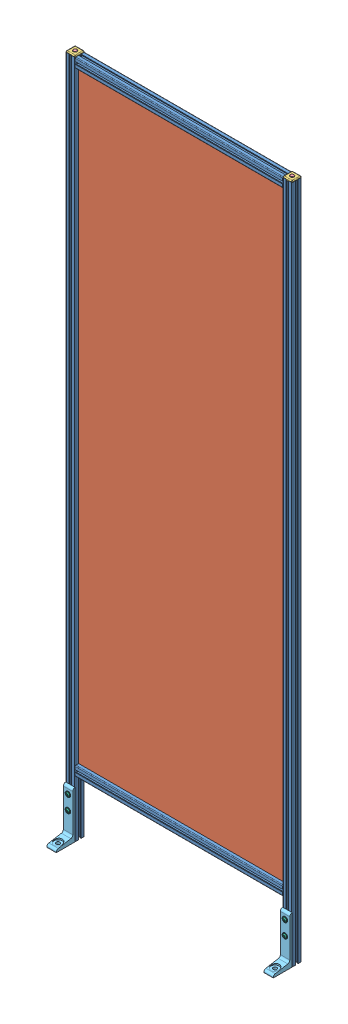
SolidWorks assembly 10-10 Guarding.sldasm, configuration Default (file format 4700). Lengths in mm.
Overall size (609.6 1833.07 76.2).
27 component instances, 7 part files, 27 mates.
Components (placement in the parent):
- 650000-1: 650000.sldprt [72] at (-12.7 -1828.8 -12.7) x (-1 0 0) z (0 -1 0) size (25.4 25.4 1828.8)
- 650000-2: 650000.sldprt [22] at (-25.4 -12.7 -12.7) x (0 1 0) z (1 0 0) size (25.4 25.4 558.8)
- 650000-3: 650000.sldprt [72] at (-596.9 0 -12.7) x (1 0 0) z (0 1 0) size (25.4 25.4 1828.8)
- 650000-4: 650000.sldprt [22] at (-25.4 -1663.7 -12.7) x (0 -1 0) z (1 0 0) size (25.4 25.4 558.8)
- 655433-2: 655433.sldprt [22.5x64.5] at (-590.55 -1657.35 -14.9479) x (0 0 1) z (-1 0 0) size (4.5 1638.3 571.5)
- 655000-1: 655000.sldasm [Default] at (-596.9 0 -12.7) x (0 0 -1) z (0 1 0) size (25.4 25.4 14.43)
  - TSLOT ENDCAPS-1: TSLOT ENDCAPS.SLDPRT [1010_655000] at origin size (25.4 25.4 5.46)
  - 651084-1: 651084.SLDPRT [Default] at (-0.0554 -0.0554 4.2672) x (-0.923728 -0.383049 0) z (0 0 -1) size (9.98 9.98 14.43)
- 655000-2: 655000.sldasm [Default] at (-12.7 0 -12.7) x (0 0 1) z (0 1 0) size (25.4 25.4 14.43)
  - TSLOT ENDCAPS-1: TSLOT ENDCAPS.SLDPRT [1010_655000] at origin size (25.4 25.4 5.46)
  - 651084-1: 651084.SLDPRT [Default] at (-0.0554 -0.0554 4.2672) x (-0.923728 -0.383049 0) z (0 0 -1) size (9.98 9.98 14.43)
- 655275-1: 655275.sldasm [655275 (With Recomended Fasteners)] at (-596.9 -1828.8 0) x (0 1 0) z (1 0 0) size (127 57.15 25.4)
  - Econ BP-1: Econ BP.SLDPRT [655275] at origin size (127 50.8 25.4)
  - 651130-1: 651130.SLDASM [Default] at (107.95 -6.35 0) x (0 0 1) z (-1 0 0) size (13.72 16 25.4)
    - FBHSCS-1: FBHSCS.SLDPRT [651136] at origin size (13.72 16 13.72)
    - 651163-1: 651163.SLDPRT [Default] at (-5.588 1.27 12.7) x (0 0 -1) z (0 -1 0) size (25.4 11.18 3.66)
  - 651130-2: 651130.SLDASM [Default] at (69.85 -6.35 0) x (0 0 1) z (-1 0 0) size (13.72 16 25.4)
    - FBHSCS-1: FBHSCS.SLDPRT [651136] at origin size (13.72 16 13.72)
    - 651163-1: 651163.SLDPRT [Default] at (-5.588 1.27 12.7) x (0 0 -1) z (0 -1 0) size (25.4 11.18 3.66)
- 655275-2: 655275.sldasm [655275 (With Recomended Fasteners)] at (-12.7 -1828.8 0) x (0 1 0) z (1 0 0) size (127 57.15 25.4)
  - Econ BP-1: Econ BP.SLDPRT [655275] at origin size (127 50.8 25.4)
  - 651130-1: 651130.SLDASM [Default] at (107.95 -6.35 0) x (0 0 1) z (-1 0 0) size (13.72 16 25.4)
    - FBHSCS-1: FBHSCS.SLDPRT [651136] at origin size (13.72 16 13.72)
    - 651163-1: 651163.SLDPRT [Default] at (-5.588 1.27 12.7) x (0 0 -1) z (0 -1 0) size (25.4 11.18 3.66)
  - 651130-2: 651130.SLDASM [Default] at (69.85 -6.35 0) x (0 0 1) z (-1 0 0) size (13.72 16 25.4)
    - FBHSCS-1: FBHSCS.SLDPRT [651136] at origin size (13.72 16 13.72)
    - 651163-1: 651163.SLDPRT [Default] at (-5.588 1.27 12.7) x (0 0 -1) z (0 -1 0) size (25.4 11.18 3.66)
Mates (geometry in assembly coordinates):
- Coincident1: coincident anti-aligned: plane of 650000-1; plane of 650000-2 through (-542.4905 -12.7 -12.7) normal (1 0 0)
- Coincident3: coincident aligned: plane of 650000-1; plane of 650000-2
- Coincident5: coincident anti-aligned: plane of 650000-1 through (-529.7905 -1828.8 -12.7) normal (0 0 -1); plane of 650000-2
- Coincident7: coincident anti-aligned: plane of 650000-2 through (-1101.2905 -12.7 -12.7) normal (-1 0 0); plane of 650000-3
- Coincident10: coincident anti-aligned: plane of 650000-2; plane of 650000-3
- Coincident11: coincident aligned: plane of 650000-2 through (-1101.2905 0 -15.9258) normal (0 1 0); plane of 650000-3 through (-1124.6585 0 -2.032) normal (0 1 0)
- Coincident12: coincident anti-aligned: plane of 650000-1; plane of 650000-4 through (-542.4905 -1663.7 -12.7) normal (1 0 0)
- Coincident13: coincident aligned: plane of 650000-1 through (-529.7905 -1828.8 -12.7) normal (0 0 -1); plane of 650000-4
- Distance1: distance = 152.4 mm aligned: plane of 650000-4 through (-584.2 -1676.4 -15.9258) normal (0 -1 0); plane of 650000-1 through (-2.032 -1828.8 -2.032) normal (0 -1 0)
- Width1: width aligned: plane of 655433-2 through (-536.1405 -1657.35 -10.4521) normal (1 0 0); plane of 655433-2 through (-1107.6405 -1657.35 -10.4521) normal (-1 0 0); plane of 650000-1 through (-517.0905 0 -15.9258) normal (1 0 0); plane of 650000-3 through (-1126.6905 -1828.8 -15.9258) normal (-1 0 0)
- Width2: width aligned: plane of 655433-2 through (-1107.6405 -19.05 -10.4521) normal (0 1 0); plane of 655433-2 through (-1107.6405 -1657.35 -10.4521) normal (0 -1 0); plane of 650000-2 through (-1101.2905 0 -15.9258) normal (0 1 0); plane of 650000-4 through (-1101.2905 -1676.4 -15.9258) normal (0 -1 0)
- Width3: width anti-aligned: plane of 655433-2 through (-1107.6405 -19.05 -10.4521) normal (0 0 1); plane of 655433-2 through (-1107.6405 -19.05 -14.9479) normal (0 0 -1); plane of 650000-2 through (-1101.2905 -9.4742 -25.4) normal (0 0 -1); plane of 650000-2 through (-1101.2905 -9.4742 0) normal (0 0 1)
- Coincident15: coincident anti-aligned: plane of 650000-3 through (-1113.9905 0 -12.7) normal (0 1 0); plane of 655000-1
- Coincident16: coincident anti-aligned: plane of 650000-3; plane of 655000-1
- Coincident17: coincident aligned: plane of 650000-3; plane of 655000-1
- Coincident18: coincident anti-aligned: plane of 650000-1; plane of 655000-2
- Coincident19: coincident anti-aligned: plane of 650000-1; plane of 655000-2
- Coincident20: coincident anti-aligned: plane of 650000-1 through (-529.7905 -1828.8 -12.7) normal (0 0 -1); plane of 655000-2
- Coincident21: coincident aligned: plane of 650000-3; plane of 655275-1
- Coincident22: coincident anti-aligned: plane of 650000-3 through (-1113.9905 0 0) normal (0 0 1); plane of 655275-1
- Coincident23: coincident aligned: plane of 650000-3; plane of 655275-1 through (-1113.9905 -1828.8 0) normal (1 0 0)
- Coincident24: coincident aligned: plane of 650000-1 through (-529.7905 -1828.8 -12.7) normal (0 -1 0); plane of 655275-2
- Coincident25: coincident anti-aligned: plane of 650000-1; plane of 655275-2
- Coincident26: coincident anti-aligned: plane of 650000-1; plane of 655275-2 through (-529.7905 -1828.8 0) normal (1 0 0)
- Coincident27: coincident aligned: plane of ? through (-1101.2905 -9.4742 0) normal (0 0 1)
- Coincident28: coincident aligned: plane of 650000-2 through (-584.2 0 -15.9258) normal (0 1 0); plane of assembly
- Coincident29: coincident aligned: plane of 650000-1 through (0 0 -9.4742) normal (1 0 0); plane of assembly
